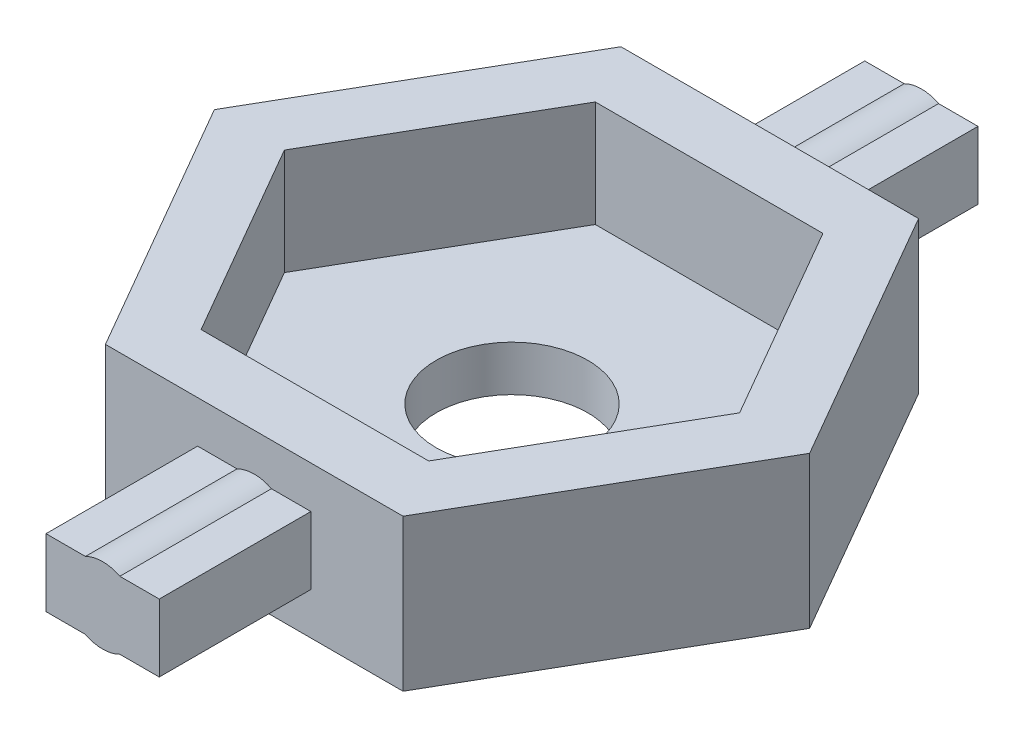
from build123d import *

# Parameters (mm, degrees)
SKETCH1_R           = 1.25
BOSS_EXTRUDE3_DEPTH = 0.75
BOSS_EXTRUDE4_DEPTH = 2.5
BOSS_EXTRUDE5_DEPTH = 2.5


with BuildPart() as part:
    # Sketch1 → Boss-Extrude3 (new body)
    with BuildSketch(Plane(origin=(0, 0, 0), x_dir=(1, 0, 0), z_dir=(0, 1, 0))):
        Polygon((-1.876388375, -3.25), (1.876388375, -3.25), (3.75277675, 0), (1.876388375, 3.25), (-1.876388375, 3.25), (-3.75277675, 0), align=None)
        with Locations(Location((0, 0, 0), (0, 0, 270))):
            Circle(SKETCH1_R, mode=Mode.SUBTRACT)
    extrude(amount=BOSS_EXTRUDE3_DEPTH)

    # Sketch1_3 → Boss-Extrude4 (add)
    with BuildSketch(Plane(origin=(0, 0, 0), x_dir=(1, 0, 0), z_dir=(0, 1, 0))):
        Polygon((-2.453738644, -4.25), (2.453738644, -4.25), (4.907477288, 0), (2.453738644, 4.25), (-2.453738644, 4.25), (-4.907477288, 0), align=None)
        Polygon((1.876388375, -3.25), (3.75277675, 0), (1.876388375, 3.25), (-1.876388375, 3.25), (-3.75277675, 0), (-1.876388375, -3.25), align=None, mode=Mode.SUBTRACT)
    extrude(amount=BOSS_EXTRUDE4_DEPTH)

    # Sketch3 → Boss-Extrude5 (add)
    with BuildSketch(Plane.XY.offset(-4.25)):
        with BuildLine():
            Line((-0.933679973, 1.806937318), (-0.283629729, 1.806937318))
            ThreePointArc((-0.283629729, 1.806937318), (0, 1.875), (0.283629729, 1.806937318))
            Line((0.283629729, 1.806937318), (0.933679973, 1.806937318))
            Line((0.933679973, 1.806937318), (0.933679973, 0.693062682))
            Line((0.933679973, 0.693062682), (0.283629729, 0.693062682))
            ThreePointArc((0.283629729, 0.693062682), (0, 0.625), (-0.283629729, 0.693062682))
            Line((-0.283629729, 0.693062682), (-0.933679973, 0.693062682))
            Line((-0.933679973, 0.693062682), (-0.933679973, 1.806937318))
        make_face()
    boss_extrude5 = extrude(amount=-BOSS_EXTRUDE5_DEPTH)

    # Mirror2: Boss-Extrude5 across plane
    add(boss_extrude5.mirror(Plane.XY))


solid = part.part
